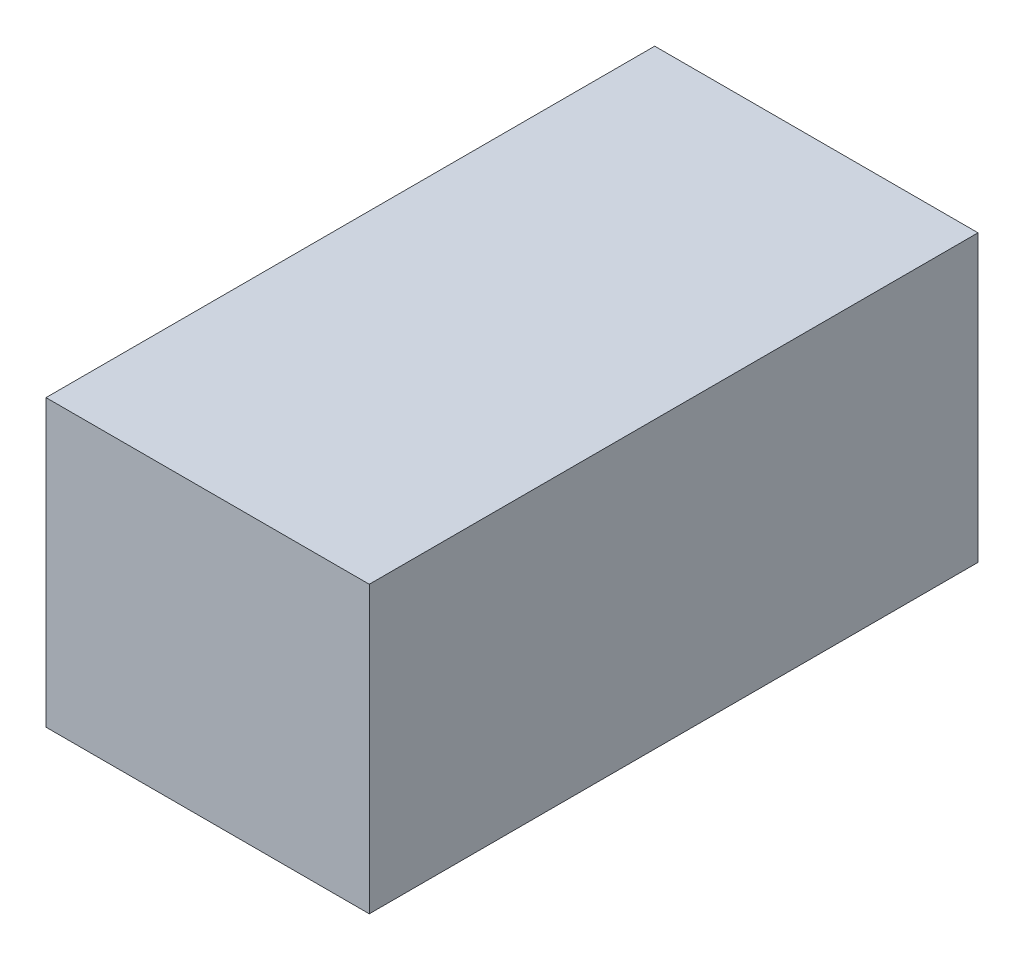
ISO-10303-21;
HEADER;
FILE_DESCRIPTION(('STEP AP214'),'2;1');
FILE_NAME('part.step','',(''),(''),'','','');
FILE_SCHEMA(('AUTOMOTIVE_DESIGN { 1 0 10303 214 1 1 1 1 }'));
ENDSEC;
DATA;
#1=APPLICATION_CONTEXT('core data for automotive mechanical design processes');
#2=APPLICATION_PROTOCOL_DEFINITION('international standard','automotive_design',2000,#1);
#3=PRODUCT_CONTEXT('',#1,'mechanical');
#4=PRODUCT('Part','Part','',(#3));
#5=PRODUCT_RELATED_PRODUCT_CATEGORY('part','',(#4));
#6=PRODUCT_DEFINITION_FORMATION('','',#4);
#7=PRODUCT_DEFINITION_CONTEXT('part definition',#1,'design');
#8=PRODUCT_DEFINITION('design','',#6,#7);
#9=PRODUCT_DEFINITION_SHAPE('','',#8);
#10=(LENGTH_UNIT() NAMED_UNIT(*) SI_UNIT(.MILLI.,.METRE.));
#11=(NAMED_UNIT(*) PLANE_ANGLE_UNIT() SI_UNIT($,.RADIAN.));
#12=(NAMED_UNIT(*) SI_UNIT($,.STERADIAN.) SOLID_ANGLE_UNIT());
#13=UNCERTAINTY_MEASURE_WITH_UNIT(LENGTH_MEASURE(1.E-05),#10,'distance_accuracy_value','');
#14=(GEOMETRIC_REPRESENTATION_CONTEXT(3) GLOBAL_UNCERTAINTY_ASSIGNED_CONTEXT((#13)) GLOBAL_UNIT_ASSIGNED_CONTEXT((#10,
#11,#12)) REPRESENTATION_CONTEXT('',''));
#15=CARTESIAN_POINT('',(0.,0.,0.));
#16=DIRECTION('',(0.,0.,1.));
#17=DIRECTION('',(1.,0.,0.));
#18=AXIS2_PLACEMENT_3D('',#15,#16,#17);
#19=CARTESIAN_POINT('',(11.938,-10.541,44.958));
#20=DIRECTION('',(-1.,0.,0.));
#21=DIRECTION('',(0.,0.,1.));
#22=AXIS2_PLACEMENT_3D('',#19,#20,#21);
#23=PLANE('',#22);
#24=DIRECTION('',(0.,1.,0.));
#25=VECTOR('',#24,1.);
#26=CARTESIAN_POINT('',(11.938,-10.541,0.));
#27=LINE('',#26,#25);
#28=CARTESIAN_POINT('',(11.938,-10.541,0.));
#29=VERTEX_POINT('',#28);
#30=CARTESIAN_POINT('',(11.938,10.541,0.));
#31=VERTEX_POINT('',#30);
#32=EDGE_CURVE('E96',#29,#31,#27,.T.);
#33=ORIENTED_EDGE('',*,*,#32,.T.);
#34=DIRECTION('',(0.,0.,-1.));
#35=VECTOR('',#34,1.);
#36=CARTESIAN_POINT('',(11.938,10.541,44.958));
#37=LINE('',#36,#35);
#38=CARTESIAN_POINT('',(11.938,10.541,44.958));
#39=VERTEX_POINT('',#38);
#40=EDGE_CURVE('E11',#39,#31,#37,.T.);
#41=ORIENTED_EDGE('',*,*,#40,.F.);
#42=DIRECTION('',(0.,1.,0.));
#43=VECTOR('',#42,1.);
#44=CARTESIAN_POINT('',(11.938,-10.541,44.958));
#45=LINE('',#44,#43);
#46=CARTESIAN_POINT('',(11.938,-10.541,44.958));
#47=VERTEX_POINT('',#46);
#48=EDGE_CURVE('E84',#47,#39,#45,.T.);
#49=ORIENTED_EDGE('',*,*,#48,.F.);
#50=DIRECTION('',(0.,0.,-1.));
#51=VECTOR('',#50,1.);
#52=CARTESIAN_POINT('',(11.938,-10.541,44.958));
#53=LINE('',#52,#51);
#54=EDGE_CURVE('E92',#47,#29,#53,.T.);
#55=ORIENTED_EDGE('',*,*,#54,.T.);
#56=EDGE_LOOP('',(#33,#41,#49,#55));
#57=FACE_BOUND('',#56,.T.);
#58=ADVANCED_FACE('F33',(#57),#23,.F.);
#59=CARTESIAN_POINT('',(-11.938,10.541,44.958));
#60=DIRECTION('',(0.,-1.,0.));
#61=DIRECTION('',(0.,0.,-1.));
#62=AXIS2_PLACEMENT_3D('',#59,#60,#61);
#63=PLANE('',#62);
#64=DIRECTION('',(-1.,0.,0.));
#65=VECTOR('',#64,1.);
#66=CARTESIAN_POINT('',(-11.938,10.541,0.));
#67=LINE('',#66,#65);
#68=CARTESIAN_POINT('',(-11.938,10.541,0.));
#69=VERTEX_POINT('',#68);
#70=EDGE_CURVE('E88',#31,#69,#67,.T.);
#71=ORIENTED_EDGE('',*,*,#70,.T.);
#72=DIRECTION('',(0.,0.,-1.));
#73=VECTOR('',#72,1.);
#74=CARTESIAN_POINT('',(-11.938,10.541,44.958));
#75=LINE('',#74,#73);
#76=CARTESIAN_POINT('',(-11.938,10.541,44.958));
#77=VERTEX_POINT('',#76);
#78=EDGE_CURVE('E41',#77,#69,#75,.T.);
#79=ORIENTED_EDGE('',*,*,#78,.F.);
#80=DIRECTION('',(-1.,0.,0.));
#81=VECTOR('',#80,1.);
#82=CARTESIAN_POINT('',(-11.938,10.541,44.958));
#83=LINE('',#82,#81);
#84=EDGE_CURVE('E79',#39,#77,#83,.T.);
#85=ORIENTED_EDGE('',*,*,#84,.F.);
#86=ORIENTED_EDGE('',*,*,#40,.T.);
#87=EDGE_LOOP('',(#71,#79,#85,#86));
#88=FACE_BOUND('',#87,.T.);
#89=ADVANCED_FACE('F87',(#88),#63,.F.);
#90=CARTESIAN_POINT('',(-11.938,-10.541,44.958));
#91=DIRECTION('',(1.,0.,0.));
#92=DIRECTION('',(0.,0.,-1.));
#93=AXIS2_PLACEMENT_3D('',#90,#91,#92);
#94=PLANE('',#93);
#95=DIRECTION('',(0.,-1.,0.));
#96=VECTOR('',#95,1.);
#97=CARTESIAN_POINT('',(-11.938,-10.541,0.));
#98=LINE('',#97,#96);
#99=CARTESIAN_POINT('',(-11.938,-10.541,0.));
#100=VERTEX_POINT('',#99);
#101=EDGE_CURVE('E66',#69,#100,#98,.T.);
#102=ORIENTED_EDGE('',*,*,#101,.T.);
#103=DIRECTION('',(0.,0.,-1.));
#104=VECTOR('',#103,1.);
#105=CARTESIAN_POINT('',(-11.938,-10.541,44.958));
#106=LINE('',#105,#104);
#107=CARTESIAN_POINT('',(-11.938,-10.541,44.958));
#108=VERTEX_POINT('',#107);
#109=EDGE_CURVE('E89',#108,#100,#106,.T.);
#110=ORIENTED_EDGE('',*,*,#109,.F.);
#111=DIRECTION('',(0.,-1.,0.));
#112=VECTOR('',#111,1.);
#113=CARTESIAN_POINT('',(-11.938,-10.541,44.958));
#114=LINE('',#113,#112);
#115=EDGE_CURVE('E82',#77,#108,#114,.T.);
#116=ORIENTED_EDGE('',*,*,#115,.F.);
#117=ORIENTED_EDGE('',*,*,#78,.T.);
#118=EDGE_LOOP('',(#102,#110,#116,#117));
#119=FACE_BOUND('',#118,.T.);
#120=ADVANCED_FACE('F90',(#119),#94,.F.);
#121=CARTESIAN_POINT('',(-11.938,-10.541,44.958));
#122=DIRECTION('',(0.,1.,0.));
#123=DIRECTION('',(0.,0.,1.));
#124=AXIS2_PLACEMENT_3D('',#121,#122,#123);
#125=PLANE('',#124);
#126=DIRECTION('',(1.,0.,0.));
#127=VECTOR('',#126,1.);
#128=CARTESIAN_POINT('',(-11.938,-10.541,0.));
#129=LINE('',#128,#127);
#130=EDGE_CURVE('E72',#100,#29,#129,.T.);
#131=ORIENTED_EDGE('',*,*,#130,.T.);
#132=ORIENTED_EDGE('',*,*,#54,.F.);
#133=DIRECTION('',(1.,0.,0.));
#134=VECTOR('',#133,1.);
#135=CARTESIAN_POINT('',(-11.938,-10.541,44.958));
#136=LINE('',#135,#134);
#137=EDGE_CURVE('E49',#108,#47,#136,.T.);
#138=ORIENTED_EDGE('',*,*,#137,.F.);
#139=ORIENTED_EDGE('',*,*,#109,.T.);
#140=EDGE_LOOP('',(#131,#132,#138,#139));
#141=FACE_BOUND('',#140,.T.);
#142=ADVANCED_FACE('F103',(#141),#125,.F.);
#143=CARTESIAN_POINT('',(0.,0.,44.958));
#144=DIRECTION('',(0.,0.,-1.));
#145=DIRECTION('',(-1.,0.,0.));
#146=AXIS2_PLACEMENT_3D('',#143,#144,#145);
#147=PLANE('',#146);
#148=ORIENTED_EDGE('',*,*,#48,.T.);
#149=ORIENTED_EDGE('',*,*,#84,.T.);
#150=ORIENTED_EDGE('',*,*,#115,.T.);
#151=ORIENTED_EDGE('',*,*,#137,.T.);
#152=EDGE_LOOP('',(#148,#149,#150,#151));
#153=FACE_BOUND('',#152,.T.);
#154=ADVANCED_FACE('F80',(#153),#147,.F.);
#155=CARTESIAN_POINT('',(0.,0.,0.));
#156=DIRECTION('',(0.,0.,-1.));
#157=DIRECTION('',(-1.,0.,0.));
#158=AXIS2_PLACEMENT_3D('',#155,#156,#157);
#159=PLANE('',#158);
#160=ORIENTED_EDGE('',*,*,#32,.F.);
#161=ORIENTED_EDGE('',*,*,#130,.F.);
#162=ORIENTED_EDGE('',*,*,#101,.F.);
#163=ORIENTED_EDGE('',*,*,#70,.F.);
#164=EDGE_LOOP('',(#160,#161,#162,#163));
#165=FACE_BOUND('',#164,.T.);
#166=ADVANCED_FACE('F106',(#165),#159,.T.);
#167=CLOSED_SHELL('',(#58,#89,#120,#142,#154,#166));
#168=MANIFOLD_SOLID_BREP('B2',#167);
#169=ADVANCED_BREP_SHAPE_REPRESENTATION('',(#18,#168),#14);
#170=SHAPE_DEFINITION_REPRESENTATION(#9,#169);
ENDSEC;
END-ISO-10303-21;
